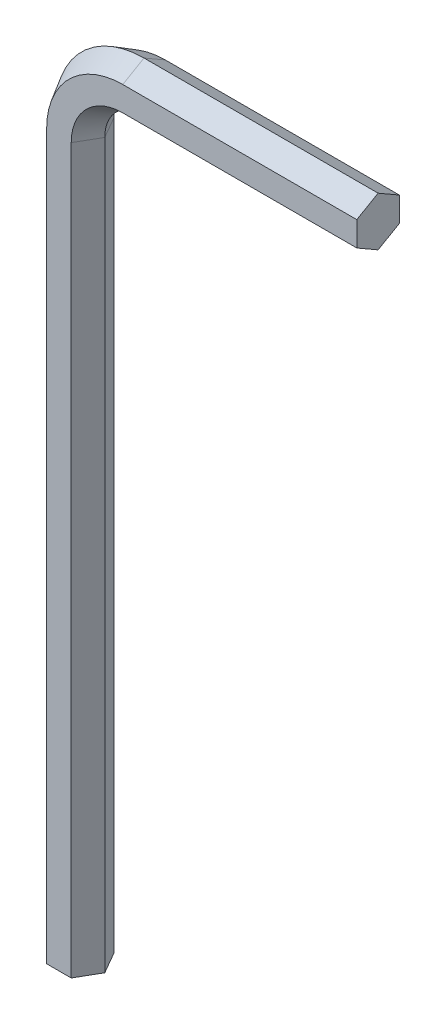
from build123d import *


with BuildPart() as part:
    # Balayage1: sweep along a path in Esquisse2
    with BuildLine(Plane.XY) as balayage1_path:
        Line((0, 0), (0, 68))
        ThreePointArc((0, 68), (1.757359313, 72.242640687), (6, 74))
        Line((6, 74), (28, 74))
    # Esquisse1 → Balayage1 (sweep)
    with BuildSketch(Plane(origin=(0, 0, 0), x_dir=(1, 0, 0), z_dir=(0, 1, 0))):
        Polygon((2.309401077, 0), (1.154700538, 2), (-1.154700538, 2), (-2.309401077, 0), (-1.154700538, -2), (1.154700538, -2), align=None)
    sweep(path=balayage1_path.line)


solid = part.part
